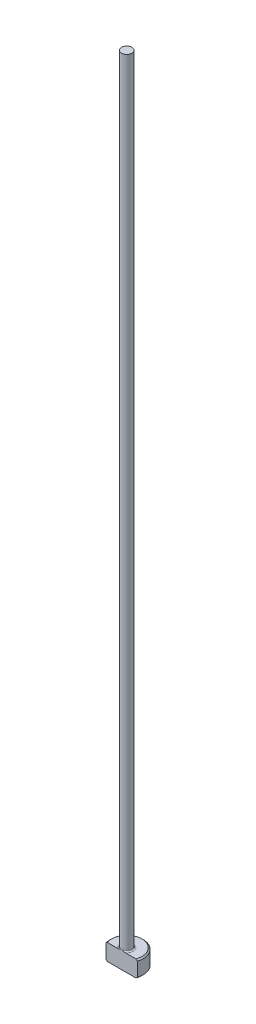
ISO-10303-21;
HEADER;
FILE_DESCRIPTION(('STEP AP214'),'2;1');
FILE_NAME('part.step','',(''),(''),'','','');
FILE_SCHEMA(('AUTOMOTIVE_DESIGN { 1 0 10303 214 1 1 1 1 }'));
ENDSEC;
DATA;
#1=APPLICATION_CONTEXT('core data for automotive mechanical design processes');
#2=APPLICATION_PROTOCOL_DEFINITION('international standard','automotive_design',2000,#1);
#3=PRODUCT_CONTEXT('',#1,'mechanical');
#4=PRODUCT('Part','Part','',(#3));
#5=PRODUCT_RELATED_PRODUCT_CATEGORY('part','',(#4));
#6=PRODUCT_DEFINITION_FORMATION('','',#4);
#7=PRODUCT_DEFINITION_CONTEXT('part definition',#1,'design');
#8=PRODUCT_DEFINITION('design','',#6,#7);
#9=PRODUCT_DEFINITION_SHAPE('','',#8);
#10=(LENGTH_UNIT() NAMED_UNIT(*) SI_UNIT(.MILLI.,.METRE.));
#11=(NAMED_UNIT(*) PLANE_ANGLE_UNIT() SI_UNIT($,.RADIAN.));
#12=(NAMED_UNIT(*) SI_UNIT($,.STERADIAN.) SOLID_ANGLE_UNIT());
#13=UNCERTAINTY_MEASURE_WITH_UNIT(LENGTH_MEASURE(1.E-05),#10,'distance_accuracy_value','');
#14=(GEOMETRIC_REPRESENTATION_CONTEXT(3) GLOBAL_UNCERTAINTY_ASSIGNED_CONTEXT((#13)) GLOBAL_UNIT_ASSIGNED_CONTEXT((#10,
#11,#12)) REPRESENTATION_CONTEXT('',''));
#15=CARTESIAN_POINT('',(0.,0.,0.));
#16=DIRECTION('',(0.,0.,1.));
#17=DIRECTION('',(1.,0.,0.));
#18=AXIS2_PLACEMENT_3D('',#15,#16,#17);
#19=CARTESIAN_POINT('',(0.,0.,0.));
#20=DIRECTION('',(0.,-1.,0.));
#21=DIRECTION('',(0.,0.,-1.));
#22=AXIS2_PLACEMENT_3D('',#19,#20,#21);
#23=PLANE('',#22);
#24=CARTESIAN_POINT('',(0.,0.,0.));
#25=DIRECTION('',(0.,-1.,0.));
#26=DIRECTION('',(0.,0.,-1.));
#27=AXIS2_PLACEMENT_3D('',#24,#25,#26);
#28=CIRCLE('',#27,2.92099999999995);
#29=CARTESIAN_POINT('',(-2.74744151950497,0.,0.991869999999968));
#30=VERTEX_POINT('',#29);
#31=CARTESIAN_POINT('',(2.74744151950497,0.,0.991869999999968));
#32=VERTEX_POINT('',#31);
#33=EDGE_CURVE('E98',#30,#32,#28,.T.);
#34=ORIENTED_EDGE('',*,*,#33,.T.);
#35=DIRECTION('',(-1.,0.,0.));
#36=VECTOR('',#35,1.);
#37=CARTESIAN_POINT('',(-3.01609331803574,0.,0.991869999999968));
#38=LINE('',#37,#36);
#39=EDGE_CURVE('E83',#32,#30,#38,.T.);
#40=ORIENTED_EDGE('',*,*,#39,.T.);
#41=EDGE_LOOP('',(#34,#40));
#42=FACE_BOUND('',#41,.T.);
#43=ADVANCED_FACE('F32',(#42),#23,.T.);
#44=CARTESIAN_POINT('',(0.,259.958771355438,0.));
#45=DIRECTION('',(0.,1.,0.));
#46=DIRECTION('',(0.,0.,1.));
#47=AXIS2_PLACEMENT_3D('',#44,#45,#46);
#48=CYLINDRICAL_SURFACE('',#47,3.17499999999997);
#49=CARTESIAN_POINT('',(0.,2.92099999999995,0.));
#50=DIRECTION('',(0.,1.,0.));
#51=DIRECTION('',(0.,0.,1.));
#52=AXIS2_PLACEMENT_3D('',#49,#50,#51);
#53=CIRCLE('',#52,3.17499999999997);
#54=CARTESIAN_POINT('',(-3.01609331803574,2.92099999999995,0.991869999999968));
#55=VERTEX_POINT('',#54);
#56=CARTESIAN_POINT('',(3.01609331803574,2.92099999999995,0.991869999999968));
#57=VERTEX_POINT('',#56);
#58=EDGE_CURVE('E104',#55,#57,#53,.F.);
#59=ORIENTED_EDGE('',*,*,#58,.T.);
#60=DIRECTION('',(0.,-1.,0.));
#61=VECTOR('',#60,1.);
#62=CARTESIAN_POINT('',(3.01609331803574,152.4,0.991869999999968));
#63=LINE('',#62,#61);
#64=CARTESIAN_POINT('',(3.01609331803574,0.254000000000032,0.991869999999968));
#65=VERTEX_POINT('',#64);
#66=EDGE_CURVE('E183',#57,#65,#63,.T.);
#67=ORIENTED_EDGE('',*,*,#66,.T.);
#68=CARTESIAN_POINT('',(0.,0.254000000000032,0.));
#69=DIRECTION('',(0.,-1.,0.));
#70=DIRECTION('',(0.,0.,-1.));
#71=AXIS2_PLACEMENT_3D('',#68,#69,#70);
#72=CIRCLE('',#71,3.17499999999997);
#73=CARTESIAN_POINT('',(-3.01609331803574,0.254000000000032,0.991869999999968));
#74=VERTEX_POINT('',#73);
#75=EDGE_CURVE('E100',#65,#74,#72,.F.);
#76=ORIENTED_EDGE('',*,*,#75,.T.);
#77=DIRECTION('',(0.,-1.,0.));
#78=VECTOR('',#77,1.);
#79=CARTESIAN_POINT('',(-3.01609331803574,152.4,0.991869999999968));
#80=LINE('',#79,#78);
#81=EDGE_CURVE('E93',#55,#74,#80,.T.);
#82=ORIENTED_EDGE('',*,*,#81,.F.);
#83=EDGE_LOOP('',(#59,#67,#76,#82));
#84=FACE_BOUND('',#83,.T.);
#85=ADVANCED_FACE('F158',(#84),#48,.T.);
#86=CARTESIAN_POINT('',(-3.17499999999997,3.175,0.));
#87=DIRECTION('',(0.,1.,0.));
#88=DIRECTION('',(0.,0.,1.));
#89=AXIS2_PLACEMENT_3D('',#86,#87,#88);
#90=PLANE('',#89);
#91=CARTESIAN_POINT('',(0.,3.175,0.));
#92=DIRECTION('',(0.,1.,0.));
#93=DIRECTION('',(0.,0.,1.));
#94=AXIS2_PLACEMENT_3D('',#91,#92,#93);
#95=CIRCLE('',#94,2.92099999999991);
#96=CARTESIAN_POINT('',(2.74744151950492,3.175,0.991869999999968));
#97=VERTEX_POINT('',#96);
#98=CARTESIAN_POINT('',(-2.74744151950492,3.175,0.991869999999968));
#99=VERTEX_POINT('',#98);
#100=EDGE_CURVE('E178',#97,#99,#95,.T.);
#101=ORIENTED_EDGE('',*,*,#100,.T.);
#102=DIRECTION('',(1.,0.,0.));
#103=VECTOR('',#102,1.);
#104=CARTESIAN_POINT('',(-3.17499999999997,3.175,0.991869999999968));
#105=LINE('',#104,#103);
#106=CARTESIAN_POINT('',(-0.753913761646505,3.17500000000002,0.991869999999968));
#107=VERTEX_POINT('',#106);
#108=EDGE_CURVE('E57',#99,#107,#105,.T.);
#109=ORIENTED_EDGE('',*,*,#108,.T.);
#110=CARTESIAN_POINT('',(0.,3.175,0.));
#111=DIRECTION('',(0.,1.,0.));
#112=DIRECTION('',(0.,0.,1.));
#113=AXIS2_PLACEMENT_3D('',#110,#111,#112);
#114=CIRCLE('',#113,1.24586999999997);
#115=CARTESIAN_POINT('',(0.753913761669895,3.17500000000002,0.991869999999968));
#116=VERTEX_POINT('',#115);
#117=EDGE_CURVE('E107',#107,#116,#114,.F.);
#118=ORIENTED_EDGE('',*,*,#117,.T.);
#119=EDGE_CURVE('E136',#116,#97,#105,.T.);
#120=ORIENTED_EDGE('',*,*,#119,.T.);
#121=EDGE_LOOP('',(#101,#109,#118,#120));
#122=FACE_BOUND('',#121,.T.);
#123=ADVANCED_FACE('F147',(#122),#90,.T.);
#124=CARTESIAN_POINT('',(0.,3.17499999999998,0.));
#125=DIRECTION('',(0.,-1.,0.));
#126=DIRECTION('',(0.,0.,-1.));
#127=AXIS2_PLACEMENT_3D('',#124,#125,#126);
#128=CONICAL_SURFACE('',#127,2.92099999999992,0.785398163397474);
#129=ORIENTED_EDGE('',*,*,#58,.F.);
#130=CARTESIAN_POINT('',(-6.63881246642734,-0.616498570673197,0.991869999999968));
#131=CARTESIAN_POINT('',(-6.44312621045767,-0.422969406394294,0.991869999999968));
#132=CARTESIAN_POINT('',(-6.2473550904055,-0.229525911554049,0.991869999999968));
#133=CARTESIAN_POINT('',(-5.85545987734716,0.157213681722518,0.991869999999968));
#134=CARTESIAN_POINT('',(-5.659335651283,0.350509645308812,0.991869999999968));
#135=CARTESIAN_POINT('',(-5.26477224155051,0.738726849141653,0.991869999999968));
#136=CARTESIAN_POINT('',(-5.06632973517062,0.933644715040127,0.991869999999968));
#137=CARTESIAN_POINT('',(-4.66907774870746,1.32289438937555,0.991869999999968));
#138=CARTESIAN_POINT('',(-4.47026851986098,1.51722645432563,0.991869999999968));
#139=CARTESIAN_POINT('',(-3.99842986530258,1.97685787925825,0.991869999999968));
#140=CARTESIAN_POINT('',(-3.725108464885,2.24185852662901,0.991869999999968));
#141=CARTESIAN_POINT('',(-3.31312452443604,2.63779317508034,0.991869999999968));
#142=CARTESIAN_POINT('',(-3.17533325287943,2.76963275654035,0.991869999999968));
#143=CARTESIAN_POINT('',(-2.89892508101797,3.03238768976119,0.991869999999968));
#144=CARTESIAN_POINT('',(-2.76030835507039,3.16330322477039,0.991869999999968));
#145=CARTESIAN_POINT('',(-2.482906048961,3.42276045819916,0.991869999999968));
#146=CARTESIAN_POINT('',(-2.34413040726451,3.5513127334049,0.991869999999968));
#147=CARTESIAN_POINT('',(-2.13441370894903,3.74255178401,0.991869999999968));
#148=CARTESIAN_POINT('',(-2.06422089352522,3.80605831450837,0.991869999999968));
#149=CARTESIAN_POINT('',(-1.9231794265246,3.93233800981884,0.991869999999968));
#150=CARTESIAN_POINT('',(-1.85233078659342,3.99511118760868,0.991869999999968));
#151=CARTESIAN_POINT('',(-1.71000639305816,4.11945450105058,0.991869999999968));
#152=CARTESIAN_POINT('',(-1.63853357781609,4.18102799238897,0.991869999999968));
#153=CARTESIAN_POINT('',(-1.49441993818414,4.30278887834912,0.991869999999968));
#154=CARTESIAN_POINT('',(-1.42177920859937,4.36297638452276,0.991869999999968));
#155=CARTESIAN_POINT('',(-1.27495157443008,4.48125102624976,0.991869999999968));
#156=CARTESIAN_POINT('',(-1.20076671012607,4.53934068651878,0.991869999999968));
#157=CARTESIAN_POINT('',(-1.05007271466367,4.65240890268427,0.991869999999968));
#158=CARTESIAN_POINT('',(-0.973564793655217,4.70738903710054,0.991869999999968));
#159=CARTESIAN_POINT('',(-0.875280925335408,4.77323526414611,0.991869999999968));
#160=CARTESIAN_POINT('',(-0.855113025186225,4.78650227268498,0.991869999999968));
#161=CARTESIAN_POINT('',(-0.814520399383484,4.81264212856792,0.991869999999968));
#162=CARTESIAN_POINT('',(-0.794095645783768,4.8255149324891,0.991869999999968));
#163=CARTESIAN_POINT('',(-0.732395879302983,4.86345987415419,0.991869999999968));
#164=CARTESIAN_POINT('',(-0.690699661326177,4.88785562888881,0.991869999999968));
#165=CARTESIAN_POINT('',(-0.606286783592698,4.93403928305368,0.991869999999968));
#166=CARTESIAN_POINT('',(-0.563580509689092,4.95584589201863,0.991869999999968));
#167=CARTESIAN_POINT('',(-0.476672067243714,4.99620995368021,0.991869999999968));
#168=CARTESIAN_POINT('',(-0.432470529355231,5.0147687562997,0.991869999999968));
#169=CARTESIAN_POINT('',(-0.329306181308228,5.05228686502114,0.991869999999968));
#170=CARTESIAN_POINT('',(-0.269781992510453,5.06979957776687,0.991869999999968));
#171=CARTESIAN_POINT('',(-0.179052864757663,5.0885330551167,0.991869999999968));
#172=CARTESIAN_POINT('',(-0.148613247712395,5.09351986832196,0.991869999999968));
#173=CARTESIAN_POINT('',(-0.0874154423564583,5.10074793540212,0.991869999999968));
#174=CARTESIAN_POINT('',(-0.0566574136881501,5.10299050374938,0.991869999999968));
#175=CARTESIAN_POINT('',(0.00511172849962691,5.10459993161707,0.991869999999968));
#176=CARTESIAN_POINT('',(0.0361232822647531,5.10395023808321,0.991869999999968));
#177=CARTESIAN_POINT('',(0.0979483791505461,5.09978428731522,0.991869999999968));
#178=CARTESIAN_POINT('',(0.128761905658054,5.09626779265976,0.991869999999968));
#179=CARTESIAN_POINT('',(0.220714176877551,5.08166838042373,0.991869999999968));
#180=CARTESIAN_POINT('',(0.281225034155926,5.06653323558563,0.991869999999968));
#181=CARTESIAN_POINT('',(0.400349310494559,5.027904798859,0.991869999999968));
#182=CARTESIAN_POINT('',(0.45892064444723,5.00428952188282,0.991869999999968));
#183=CARTESIAN_POINT('',(0.573499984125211,4.95139280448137,0.991869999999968));
#184=CARTESIAN_POINT('',(0.629503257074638,4.92210138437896,0.991869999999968));
#185=CARTESIAN_POINT('',(0.739751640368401,4.85948719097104,0.991869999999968));
#186=CARTESIAN_POINT('',(0.793979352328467,4.82613437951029,0.991869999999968));
#187=CARTESIAN_POINT('',(0.900666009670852,4.75683375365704,0.991869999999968));
#188=CARTESIAN_POINT('',(0.953126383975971,4.72088811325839,0.991869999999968));
#189=CARTESIAN_POINT('',(1.06104536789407,4.64408113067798,0.991869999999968));
#190=CARTESIAN_POINT('',(1.1163892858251,4.60305981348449,0.991869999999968));
#191=CARTESIAN_POINT('',(1.22590846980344,4.51948043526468,0.991869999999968));
#192=CARTESIAN_POINT('',(1.28008357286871,4.47692216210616,0.991869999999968));
#193=CARTESIAN_POINT('',(1.44133090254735,4.34754947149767,0.991869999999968));
#194=CARTESIAN_POINT('',(1.54706954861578,4.25907815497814,0.991869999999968));
#195=CARTESIAN_POINT('',(1.75655910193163,4.07945758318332,0.991869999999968));
#196=CARTESIAN_POINT('',(1.86030595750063,3.98830366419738,0.991869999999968));
#197=CARTESIAN_POINT('',(2.06632932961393,3.80441354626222,0.991869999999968));
#198=CARTESIAN_POINT('',(2.16860627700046,3.71167782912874,0.991869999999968));
#199=CARTESIAN_POINT('',(2.37189582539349,3.52538688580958,0.991869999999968));
#200=CARTESIAN_POINT('',(2.47291111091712,3.43183457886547,0.991869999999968));
#201=CARTESIAN_POINT('',(2.6742440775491,3.24396827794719,0.991869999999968));
#202=CARTESIAN_POINT('',(2.7745617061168,3.14965422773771,0.991869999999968));
#203=CARTESIAN_POINT('',(3.07453396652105,2.86609752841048,0.991869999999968));
#204=CARTESIAN_POINT('',(3.27342077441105,2.67604349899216,0.991869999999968));
#205=CARTESIAN_POINT('',(3.73814308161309,2.2291934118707,0.991869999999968));
#206=CARTESIAN_POINT('',(4.00350145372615,1.97190269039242,0.991869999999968));
#207=CARTESIAN_POINT('',(4.53313081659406,1.45600494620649,0.991869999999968));
#208=CARTESIAN_POINT('',(4.79740135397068,1.19739745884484,0.991869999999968));
#209=CARTESIAN_POINT('',(5.32485114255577,0.679796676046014,0.991869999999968));
#210=CARTESIAN_POINT('',(5.58803139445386,0.420804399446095,0.991869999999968));
#211=CARTESIAN_POINT('',(6.11378961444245,-0.097580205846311,0.991869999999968));
#212=CARTESIAN_POINT('',(6.37636778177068,-0.356972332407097,0.991869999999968));
#213=CARTESIAN_POINT('',(6.63881246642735,-0.616498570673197,0.991869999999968));
#214=B_SPLINE_CURVE_WITH_KNOTS('',3,(#130,#131,#132,#133,#134,#135,#136,#137,#138,#139,#140,
#141,#142,#143,#144,#145,#146,#147,#148,#149,#150,#151,#152,#153,#154,#155,#156,#157,#158,#159,
#160,#161,#162,#163,#164,#165,#166,#167,#168,#169,#170,#171,#172,#173,#174,#175,#176,#177,#178,
#179,#180,#181,#182,#183,#184,#185,#186,#187,#188,#189,#190,#191,#192,#193,#194,#195,#196,#197,
#198,#199,#200,#201,#202,#203,#204,#205,#206,#207,#208,#209,#210,#211,#212,#213),.UNSPECIFIED.,
.F.,.F.,(4,2,2,2,2,2,2,2,2,2,2,2,2,2,2,2,2,2,2,2,2,2,2,2,2,2,2,2,2,2,2,2,2,2,2,2,2,2,2,2,2,4),
(0.,0.825663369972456,1.65176992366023,2.48624600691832,3.32027837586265,4.46235847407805,
5.03446835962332,5.60646140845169,6.17394701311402,6.45791698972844,6.74188193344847,
7.02488468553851,7.30786457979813,7.59049172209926,7.87297407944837,7.94539117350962,
8.0178162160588,8.1626818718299,8.30642716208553,8.45011256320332,8.63549367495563,
8.72792412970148,8.82031029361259,8.91322588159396,9.00614916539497,9.19240828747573,
9.38146172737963,9.57085062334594,9.7617366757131,9.95246449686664,10.1590941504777,
10.3657524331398,10.7792760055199,11.193566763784,11.6077335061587,12.0207724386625,
12.4338421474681,13.2591119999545,14.3679437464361,15.477198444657,16.5849285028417,
17.6922142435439),.UNSPECIFIED.);
#215=EDGE_CURVE('E135',#55,#99,#214,.T.);
#216=ORIENTED_EDGE('',*,*,#215,.T.);
#217=ORIENTED_EDGE('',*,*,#100,.F.);
#218=EDGE_CURVE('E127',#97,#57,#214,.T.);
#219=ORIENTED_EDGE('',*,*,#218,.T.);
#220=EDGE_LOOP('',(#129,#216,#217,#219));
#221=FACE_BOUND('',#220,.T.);
#222=ADVANCED_FACE('F143',(#221),#128,.T.);
#223=CARTESIAN_POINT('',(0.,0.254000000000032,0.));
#224=DIRECTION('',(0.,1.,0.));
#225=DIRECTION('',(0.,0.,1.));
#226=AXIS2_PLACEMENT_3D('',#223,#224,#225);
#227=CONICAL_SURFACE('',#226,3.17499999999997,0.785398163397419);
#228=ORIENTED_EDGE('',*,*,#75,.F.);
#229=CARTESIAN_POINT('',(6.63881246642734,3.79149857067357,0.991869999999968));
#230=CARTESIAN_POINT('',(6.44312621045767,3.59796940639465,0.991869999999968));
#231=CARTESIAN_POINT('',(6.2473550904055,3.40452591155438,0.991869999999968));
#232=CARTESIAN_POINT('',(5.85545987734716,3.01778631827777,0.991869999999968));
#233=CARTESIAN_POINT('',(5.659335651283,2.82449035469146,0.991869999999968));
#234=CARTESIAN_POINT('',(5.26477224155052,2.43627315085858,0.991869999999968));
#235=CARTESIAN_POINT('',(5.06632973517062,2.24135528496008,0.991869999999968));
#236=CARTESIAN_POINT('',(4.66907774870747,1.85210561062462,0.991869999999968));
#237=CARTESIAN_POINT('',(4.470268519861,1.65777354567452,0.991869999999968));
#238=CARTESIAN_POINT('',(3.9984298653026,1.19814212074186,0.991869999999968));
#239=CARTESIAN_POINT('',(3.72510846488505,0.933141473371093,0.991869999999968));
#240=CARTESIAN_POINT('',(3.3131245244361,0.537206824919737,0.991869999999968));
#241=CARTESIAN_POINT('',(3.1753332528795,0.405367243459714,0.991869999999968));
#242=CARTESIAN_POINT('',(2.89892508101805,0.142612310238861,0.991869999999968));
#243=CARTESIAN_POINT('',(2.76030835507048,0.0116967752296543,0.991869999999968));
#244=CARTESIAN_POINT('',(2.48290604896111,-0.247760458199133,0.991869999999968));
#245=CARTESIAN_POINT('',(2.34413040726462,-0.376312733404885,0.991869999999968));
#246=CARTESIAN_POINT('',(2.13441370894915,-0.567551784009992,0.991869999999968));
#247=CARTESIAN_POINT('',(2.06422089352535,-0.631058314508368,0.991869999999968));
#248=CARTESIAN_POINT('',(1.92317942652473,-0.75733800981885,0.991869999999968));
#249=CARTESIAN_POINT('',(1.85233078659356,-0.820111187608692,0.991869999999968));
#250=CARTESIAN_POINT('',(1.71000639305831,-0.944454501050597,0.991869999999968));
#251=CARTESIAN_POINT('',(1.63853357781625,-1.00602799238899,0.991869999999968));
#252=CARTESIAN_POINT('',(1.4944199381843,-1.12778887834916,0.991869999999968));
#253=CARTESIAN_POINT('',(1.42177920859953,-1.18797638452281,0.991869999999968));
#254=CARTESIAN_POINT('',(1.27495157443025,-1.30625102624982,0.991869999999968));
#255=CARTESIAN_POINT('',(1.20076671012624,-1.36434068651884,0.991869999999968));
#256=CARTESIAN_POINT('',(1.05007271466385,-1.47740890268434,0.991869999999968));
#257=CARTESIAN_POINT('',(0.973564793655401,-1.53238903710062,0.991869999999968));
#258=CARTESIAN_POINT('',(0.875280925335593,-1.59823526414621,0.991869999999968));
#259=CARTESIAN_POINT('',(0.855113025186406,-1.61150227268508,0.991869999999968));
#260=CARTESIAN_POINT('',(0.814520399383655,-1.63764212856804,0.991869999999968));
#261=CARTESIAN_POINT('',(0.794095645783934,-1.65051493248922,0.991869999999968));
#262=CARTESIAN_POINT('',(0.732395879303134,-1.68845987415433,0.991869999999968));
#263=CARTESIAN_POINT('',(0.690699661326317,-1.71285562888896,0.991869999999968));
#264=CARTESIAN_POINT('',(0.606286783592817,-1.75903928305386,0.991869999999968));
#265=CARTESIAN_POINT('',(0.563580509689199,-1.78084589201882,0.991869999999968));
#266=CARTESIAN_POINT('',(0.476672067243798,-1.82120995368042,0.991869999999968));
#267=CARTESIAN_POINT('',(0.432470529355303,-1.83976875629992,0.991869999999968));
#268=CARTESIAN_POINT('',(0.329306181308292,-1.87728686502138,0.991869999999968));
#269=CARTESIAN_POINT('',(0.269781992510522,-1.89479957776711,0.991869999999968));
#270=CARTESIAN_POINT('',(0.179052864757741,-1.91353305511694,0.991869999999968));
#271=CARTESIAN_POINT('',(0.148613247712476,-1.9185198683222,0.991869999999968));
#272=CARTESIAN_POINT('',(0.0874154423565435,-1.92574793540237,0.991869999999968));
#273=CARTESIAN_POINT('',(0.0566574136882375,-1.92799050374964,0.991869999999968));
#274=CARTESIAN_POINT('',(-0.00511172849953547,-1.92959993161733,0.991869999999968));
#275=CARTESIAN_POINT('',(-0.0361232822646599,-1.92895023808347,0.991869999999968));
#276=CARTESIAN_POINT('',(-0.0979483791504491,-1.92478428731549,0.991869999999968));
#277=CARTESIAN_POINT('',(-0.128761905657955,-1.92126779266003,0.991869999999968));
#278=CARTESIAN_POINT('',(-0.220714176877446,-1.90666838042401,0.991869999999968));
#279=CARTESIAN_POINT('',(-0.281225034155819,-1.89153323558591,0.991869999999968));
#280=CARTESIAN_POINT('',(-0.400349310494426,-1.8529047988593,0.991869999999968));
#281=CARTESIAN_POINT('',(-0.458920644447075,-1.82928952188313,0.991869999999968));
#282=CARTESIAN_POINT('',(-0.573499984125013,-1.77639280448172,0.991869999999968));
#283=CARTESIAN_POINT('',(-0.629503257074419,-1.74710138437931,0.991869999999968));
#284=CARTESIAN_POINT('',(-0.73975164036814,-1.68448719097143,0.991869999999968));
#285=CARTESIAN_POINT('',(-0.793979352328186,-1.65113437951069,0.991869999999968));
#286=CARTESIAN_POINT('',(-0.90066600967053,-1.58183375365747,0.991869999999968));
#287=CARTESIAN_POINT('',(-0.953126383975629,-1.54588811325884,0.991869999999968));
#288=CARTESIAN_POINT('',(-1.06104536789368,-1.46908113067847,0.991869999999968));
#289=CARTESIAN_POINT('',(-1.11638928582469,-1.42805981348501,0.991869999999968));
#290=CARTESIAN_POINT('',(-1.22590846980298,-1.34448043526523,0.991869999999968));
#291=CARTESIAN_POINT('',(-1.28008357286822,-1.30192216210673,0.991869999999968));
#292=CARTESIAN_POINT('',(-1.44133090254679,-1.1725494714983,0.991869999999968));
#293=CARTESIAN_POINT('',(-1.54706954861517,-1.08407815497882,0.991869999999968));
#294=CARTESIAN_POINT('',(-1.75655910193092,-0.90445758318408,0.991869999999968));
#295=CARTESIAN_POINT('',(-1.86030595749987,-0.813303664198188,0.991869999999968));
#296=CARTESIAN_POINT('',(-2.06632932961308,-0.629413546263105,0.991869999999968));
#297=CARTESIAN_POINT('',(-2.16860627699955,-0.536677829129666,0.991869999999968));
#298=CARTESIAN_POINT('',(-2.37189582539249,-0.350386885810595,0.991869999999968));
#299=CARTESIAN_POINT('',(-2.47291111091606,-0.25683457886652,0.991869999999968));
#300=CARTESIAN_POINT('',(-2.67424407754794,-0.068968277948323,0.991869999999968));
#301=CARTESIAN_POINT('',(-2.7745617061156,0.0253457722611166,0.991869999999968));
#302=CARTESIAN_POINT('',(-3.0745339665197,0.30890247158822,0.991869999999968));
#303=CARTESIAN_POINT('',(-3.2734207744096,0.498956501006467,0.991869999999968));
#304=CARTESIAN_POINT('',(-3.73814308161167,0.945806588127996,0.991869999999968));
#305=CARTESIAN_POINT('',(-4.00350145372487,1.20309730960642,0.991869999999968));
#306=CARTESIAN_POINT('',(-4.53313081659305,1.71899505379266,0.991869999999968));
#307=CARTESIAN_POINT('',(-4.7974013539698,1.97760254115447,0.991869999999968));
#308=CARTESIAN_POINT('',(-5.32485114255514,2.4952033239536,0.991869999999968));
#309=CARTESIAN_POINT('',(-5.58803139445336,2.75419560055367,0.991869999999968));
#310=CARTESIAN_POINT('',(-6.11378961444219,3.27258020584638,0.991869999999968));
#311=CARTESIAN_POINT('',(-6.37636778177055,3.53197233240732,0.991869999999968));
#312=CARTESIAN_POINT('',(-6.63881246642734,3.79149857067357,0.991869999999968));
#313=B_SPLINE_CURVE_WITH_KNOTS('',3,(#229,#230,#231,#232,#233,#234,#235,#236,#237,#238,#239,
#240,#241,#242,#243,#244,#245,#246,#247,#248,#249,#250,#251,#252,#253,#254,#255,#256,#257,#258,
#259,#260,#261,#262,#263,#264,#265,#266,#267,#268,#269,#270,#271,#272,#273,#274,#275,#276,#277,
#278,#279,#280,#281,#282,#283,#284,#285,#286,#287,#288,#289,#290,#291,#292,#293,#294,#295,#296,
#297,#298,#299,#300,#301,#302,#303,#304,#305,#306,#307,#308,#309,#310,#311,#312),.UNSPECIFIED.,
.F.,.F.,(4,2,2,2,2,2,2,2,2,2,2,2,2,2,2,2,2,2,2,2,2,2,2,2,2,2,2,2,2,2,2,2,2,2,2,2,2,2,2,2,2,4),
(0.,0.825663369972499,1.65176992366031,2.48624600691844,3.32027837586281,4.46235847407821,
5.03446835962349,5.60646140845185,6.17394701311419,6.45791698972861,6.74188193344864,
7.02488468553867,7.3078645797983,7.59049172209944,7.87297407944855,7.94539117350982,
8.01781621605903,8.16268187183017,8.30642716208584,8.45011256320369,8.63549367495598,
8.72792412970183,8.82031029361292,8.91322588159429,9.0061491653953,9.19240828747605,
9.38146172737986,9.5708506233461,9.76173667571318,9.95246449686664,10.1590941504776,
10.3657524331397,10.7792760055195,11.1935667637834,11.6077335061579,12.0207724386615,
12.433842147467,13.2591119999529,14.3679437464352,15.4771984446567,16.584928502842,
17.6922142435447),.UNSPECIFIED.);
#314=EDGE_CURVE('E86',#65,#32,#313,.T.);
#315=ORIENTED_EDGE('',*,*,#314,.T.);
#316=ORIENTED_EDGE('',*,*,#33,.F.);
#317=EDGE_CURVE('E89',#30,#74,#313,.T.);
#318=ORIENTED_EDGE('',*,*,#317,.T.);
#319=EDGE_LOOP('',(#228,#315,#316,#318));
#320=FACE_BOUND('',#319,.T.);
#321=ADVANCED_FACE('F97',(#320),#227,.T.);
#322=CARTESIAN_POINT('',(0.,3.42900000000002,0.));
#323=DIRECTION('',(0.,1.,0.));
#324=DIRECTION('',(0.,0.,1.));
#325=AXIS2_PLACEMENT_3D('',#322,#323,#324);
#326=TOROIDAL_SURFACE('',#325,1.24586999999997,0.254);
#327=CARTESIAN_POINT('',(0.,3.42900000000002,0.991869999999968));
#328=CARTESIAN_POINT('',(4.02377171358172E-11,3.42900058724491,0.991869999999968));
#329=CARTESIAN_POINT('',(9.15420536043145E-08,3.42900117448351,0.991869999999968));
#330=CARTESIAN_POINT('',(3.97418528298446E-07,3.42900231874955,0.991869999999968));
#331=CARTESIAN_POINT('',(6.13387555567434E-07,3.42900287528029,0.991869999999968));
#332=CARTESIAN_POINT('',(1.13852671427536E-06,3.42900397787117,0.991869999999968));
#333=CARTESIAN_POINT('',(1.45202346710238E-06,3.42900452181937,0.991869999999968));
#334=CARTESIAN_POINT('',(2.14006828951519E-06,3.42900556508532,0.991869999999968));
#335=CARTESIAN_POINT('',(2.5143821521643E-06,3.42900606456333,0.991869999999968));
#336=CARTESIAN_POINT('',(3.81966318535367E-06,3.42900767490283,0.991869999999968));
#337=CARTESIAN_POINT('',(4.83193056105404E-06,3.42900872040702,0.991869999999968));
#338=CARTESIAN_POINT('',(6.96385528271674E-06,3.42901063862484,0.991869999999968));
#339=CARTESIAN_POINT('',(8.08086733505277E-06,3.42901151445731,0.991869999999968));
#340=CARTESIAN_POINT('',(1.22758630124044E-05,3.42901464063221,0.991869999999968));
#341=CARTESIAN_POINT('',(1.54854048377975E-05,3.4290167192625,0.991869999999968));
#342=CARTESIAN_POINT('',(2.19445387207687E-05,3.42902026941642,0.991869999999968));
#343=CARTESIAN_POINT('',(2.51780501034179E-05,3.42902177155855,0.991869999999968));
#344=CARTESIAN_POINT('',(3.84591566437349E-05,3.42902785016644,0.991869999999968));
#345=CARTESIAN_POINT('',(4.85743370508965E-05,3.42903226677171,0.991869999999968));
#346=CARTESIAN_POINT('',(6.78007718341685E-05,3.42903964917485,0.991869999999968));
#347=CARTESIAN_POINT('',(7.68665515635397E-05,3.42904272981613,0.991869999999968));
#348=CARTESIAN_POINT('',(0.000140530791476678,3.42906625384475,0.991869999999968));
#349=CARTESIAN_POINT('',(0.000191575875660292,3.42909512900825,0.991869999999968));
#350=CARTESIAN_POINT('',(0.000386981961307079,3.42920140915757,0.991869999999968));
#351=CARTESIAN_POINT('',(0.000533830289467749,3.42927255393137,0.991869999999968));
#352=CARTESIAN_POINT('',(0.00109306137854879,3.42954777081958,0.991869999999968));
#353=CARTESIAN_POINT('',(0.00150287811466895,3.42975838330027,0.991869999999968));
#354=CARTESIAN_POINT('',(0.00314666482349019,3.43059879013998,0.991869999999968));
#355=CARTESIAN_POINT('',(0.0043834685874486,3.43122127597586,0.991869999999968));
#356=CARTESIAN_POINT('',(0.0261880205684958,3.44220075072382,0.991869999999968));
#357=CARTESIAN_POINT('',(0.0467299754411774,3.45262603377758,0.991869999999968));
#358=CARTESIAN_POINT('',(0.0872024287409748,3.47296015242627,0.991869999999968));
#359=CARTESIAN_POINT('',(0.107130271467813,3.48287456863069,0.991869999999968));
#360=CARTESIAN_POINT('',(0.149227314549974,3.50352978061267,0.991869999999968));
#361=CARTESIAN_POINT('',(0.171408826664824,3.51424589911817,0.991869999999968));
#362=CARTESIAN_POINT('',(0.216186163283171,3.53533644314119,0.991869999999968));
#363=CARTESIAN_POINT('',(0.238783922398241,3.54570676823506,0.991869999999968));
#364=CARTESIAN_POINT('',(0.296177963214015,3.57111220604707,0.991869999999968));
#365=CARTESIAN_POINT('',(0.331156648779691,3.58574162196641,0.991869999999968));
#366=CARTESIAN_POINT('',(0.4012128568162,3.61261042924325,0.991869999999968));
#367=CARTESIAN_POINT('',(0.436273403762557,3.62489295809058,0.991869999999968));
#368=CARTESIAN_POINT('',(0.489086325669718,3.64107636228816,0.991869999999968));
#369=CARTESIAN_POINT('',(0.506509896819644,3.64604892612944,0.991869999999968));
#370=CARTESIAN_POINT('',(0.541631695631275,3.65523411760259,0.991869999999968));
#371=CARTESIAN_POINT('',(0.559330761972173,3.65944351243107,0.991869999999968));
#372=CARTESIAN_POINT('',(0.61440036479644,3.67107076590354,0.991869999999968));
#373=CARTESIAN_POINT('',(0.652120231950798,3.67696438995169,0.991869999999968));
#374=CARTESIAN_POINT('',(0.727960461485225,3.68344441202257,0.991869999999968));
#375=CARTESIAN_POINT('',(0.766079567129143,3.68404421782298,0.991869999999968));
#376=CARTESIAN_POINT('',(0.841341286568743,3.67821977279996,0.991869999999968));
#377=CARTESIAN_POINT('',(0.87848962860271,3.67191140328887,0.991869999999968));
#378=CARTESIAN_POINT('',(0.931416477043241,3.65597586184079,0.991869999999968));
#379=CARTESIAN_POINT('',(0.948237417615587,3.64979450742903,0.991869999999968));
#380=CARTESIAN_POINT('',(0.980892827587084,3.63511096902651,0.991869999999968));
#381=CARTESIAN_POINT('',(0.996725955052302,3.62660570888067,0.991869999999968));
#382=CARTESIAN_POINT('',(1.02446353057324,3.60857790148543,0.991869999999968));
#383=CARTESIAN_POINT('',(1.03659795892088,3.59941194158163,0.991869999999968));
#384=CARTESIAN_POINT('',(1.0592113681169,3.57922507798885,0.991869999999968));
#385=CARTESIAN_POINT('',(1.0696931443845,3.56820737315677,0.991869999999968));
#386=CARTESIAN_POINT('',(1.08653087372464,3.54680612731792,0.991869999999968));
#387=CARTESIAN_POINT('',(1.0932925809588,3.53674273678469,0.991869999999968));
#388=CARTESIAN_POINT('',(1.10506683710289,3.51563263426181,0.991869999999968));
#389=CARTESIAN_POINT('',(1.11008014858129,3.50458635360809,0.991869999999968));
#390=CARTESIAN_POINT('',(1.11808161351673,3.48170016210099,0.991869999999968));
#391=CARTESIAN_POINT('',(1.12105743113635,3.46985588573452,0.991869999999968));
#392=CARTESIAN_POINT('',(1.12472108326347,3.44581795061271,0.991869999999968));
#393=CARTESIAN_POINT('',(1.12540996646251,3.43362445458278,0.991869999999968));
#394=CARTESIAN_POINT('',(1.12450084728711,3.4105695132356,0.991869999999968));
#395=CARTESIAN_POINT('',(1.12312785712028,3.39969848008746,0.991869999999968));
#396=CARTESIAN_POINT('',(1.11858267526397,3.37834291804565,0.991869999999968));
#397=CARTESIAN_POINT('',(1.11541057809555,3.36785836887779,0.991869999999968));
#398=CARTESIAN_POINT('',(1.10742005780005,3.34747473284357,0.991869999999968));
#399=CARTESIAN_POINT('',(1.10259246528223,3.33757927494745,0.991869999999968));
#400=CARTESIAN_POINT('',(1.09152760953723,3.31861639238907,0.991869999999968));
#401=CARTESIAN_POINT('',(1.08528979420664,3.30954929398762,0.991869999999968));
#402=CARTESIAN_POINT('',(1.06900221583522,3.28901469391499,0.991869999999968));
#403=CARTESIAN_POINT('',(1.05841129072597,3.27797543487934,0.991869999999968));
#404=CARTESIAN_POINT('',(1.0355701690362,3.25776339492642,0.991869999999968));
#405=CARTESIAN_POINT('',(1.02331619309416,3.24859498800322,0.991869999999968));
#406=CARTESIAN_POINT('',(0.992881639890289,3.22901730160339,0.991869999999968));
#407=CARTESIAN_POINT('',(0.974188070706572,3.21940807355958,0.991869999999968));
#408=CARTESIAN_POINT('',(0.935577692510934,3.20329634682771,0.991869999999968));
#409=CARTESIAN_POINT('',(0.915661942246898,3.19679120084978,0.991869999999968));
#410=CARTESIAN_POINT('',(0.865000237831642,3.18386499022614,0.991869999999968));
#411=CARTESIAN_POINT('',(0.833830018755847,3.17912086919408,0.991869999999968));
#412=CARTESIAN_POINT('',(0.770778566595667,3.17440261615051,0.991869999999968));
#413=CARTESIAN_POINT('',(0.73889351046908,3.17449683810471,0.991869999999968));
#414=CARTESIAN_POINT('',(0.650464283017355,3.18012763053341,0.991869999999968));
#415=CARTESIAN_POINT('',(0.594197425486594,3.18987553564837,0.991869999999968));
#416=CARTESIAN_POINT('',(0.512937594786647,3.21001582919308,0.991869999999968));
#417=CARTESIAN_POINT('',(0.487059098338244,3.21737343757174,0.991869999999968));
#418=CARTESIAN_POINT('',(0.435897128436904,3.23347998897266,0.991869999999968));
#419=CARTESIAN_POINT('',(0.410611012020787,3.24222029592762,0.991869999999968));
#420=CARTESIAN_POINT('',(0.357071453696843,3.2620790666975,0.991869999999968));
#421=CARTESIAN_POINT('',(0.328879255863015,3.27335929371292,0.991869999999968));
#422=CARTESIAN_POINT('',(0.272339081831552,3.29725367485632,0.991869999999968));
#423=CARTESIAN_POINT('',(0.24400126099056,3.30989166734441,0.991869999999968));
#424=CARTESIAN_POINT('',(0.197260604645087,3.33151323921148,0.991869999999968));
#425=CARTESIAN_POINT('',(0.178755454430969,3.34027851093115,0.991869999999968));
#426=CARTESIAN_POINT('',(0.142033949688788,3.3579773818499,0.991869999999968));
#427=CARTESIAN_POINT('',(0.123816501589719,3.36690870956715,0.991869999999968));
#428=CARTESIAN_POINT('',(0.0892046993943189,3.38405351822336,0.991869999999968));
#429=CARTESIAN_POINT('',(0.0728034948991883,3.3922534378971,0.991869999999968));
#430=CARTESIAN_POINT('',(0.0394809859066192,3.40903742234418,0.991869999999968));
#431=CARTESIAN_POINT('',(0.0225613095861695,3.41762496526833,0.991869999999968));
#432=CARTESIAN_POINT('',(0.00438391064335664,3.42677853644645,0.991869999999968));
#433=CARTESIAN_POINT('',(0.00314752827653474,3.42740078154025,0.991869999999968));
#434=CARTESIAN_POINT('',(0.00150385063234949,3.42824112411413,0.991869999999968));
#435=CARTESIAN_POINT('',(0.00109371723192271,3.42845190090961,0.991869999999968));
#436=CARTESIAN_POINT('',(0.00053407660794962,3.42872731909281,0.991869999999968));
#437=CARTESIAN_POINT('',(0.000387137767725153,3.42879850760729,0.991869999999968));
#438=CARTESIAN_POINT('',(0.000191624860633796,3.42890484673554,0.991869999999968));
#439=CARTESIAN_POINT('',(0.000140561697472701,3.42893373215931,0.991869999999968));
#440=CARTESIAN_POINT('',(7.68760226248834E-05,3.42895726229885,0.991869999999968));
#441=CARTESIAN_POINT('',(6.78086317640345E-05,3.42896034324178,0.991869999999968));
#442=CARTESIAN_POINT('',(4.8578771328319E-05,3.42896772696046,0.991869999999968));
#443=CARTESIAN_POINT('',(3.84618178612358E-05,3.42897214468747,0.991869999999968));
#444=CARTESIAN_POINT('',(2.517871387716E-05,3.42897822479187,0.991869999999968));
#445=CARTESIAN_POINT('',(2.19449234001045E-05,3.4289797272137,0.991869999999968));
#446=CARTESIAN_POINT('',(1.54852829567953E-05,3.42898327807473,0.991869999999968));
#447=CARTESIAN_POINT('',(1.22755212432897E-05,3.42898535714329,0.991869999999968));
#448=CARTESIAN_POINT('',(8.08032848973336E-06,3.42898848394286,0.991869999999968));
#449=CARTESIAN_POINT('',(6.96329312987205E-06,3.42898935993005,0.991869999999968));
#450=CARTESIAN_POINT('',(4.83135367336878E-06,3.42899127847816,0.991869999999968));
#451=CARTESIAN_POINT('',(3.81909578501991E-06,3.42899232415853,0.991869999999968));
#452=CARTESIAN_POINT('',(2.51386598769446E-06,3.42899393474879,0.991869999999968));
#453=CARTESIAN_POINT('',(2.13957445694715E-06,3.42899443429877,0.991869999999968));
#454=CARTESIAN_POINT('',(1.4515869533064E-06,3.42899547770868,0.991869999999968));
#455=CARTESIAN_POINT('',(1.13812525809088E-06,3.42899602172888,0.991869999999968));
#456=CARTESIAN_POINT('',(6.13071424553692E-07,3.42899712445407,0.991869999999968));
#457=CARTESIAN_POINT('',(3.97151551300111E-07,3.42899768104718,0.991869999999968));
#458=CARTESIAN_POINT('',(9.13931195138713E-08,3.42899882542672,0.991869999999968));
#459=CARTESIAN_POINT('',(-4.02403615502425E-11,3.42899941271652,0.991869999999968));
#460=CARTESIAN_POINT('',(0.,3.42900000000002,0.991869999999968));
#461=B_SPLINE_CURVE_WITH_KNOTS('',3,(#327,#328,#329,#330,#331,#332,#333,#334,#335,#336,#337,
#338,#339,#340,#341,#342,#343,#344,#345,#346,#347,#348,#349,#350,#351,#352,#353,#354,#355,#356,
#357,#358,#359,#360,#361,#362,#363,#364,#365,#366,#367,#368,#369,#370,#371,#372,#373,#374,#375,
#376,#377,#378,#379,#380,#381,#382,#383,#384,#385,#386,#387,#388,#389,#390,#391,#392,#393,#394,
#395,#396,#397,#398,#399,#400,#401,#402,#403,#404,#405,#406,#407,#408,#409,#410,#411,#412,#413,
#414,#415,#416,#417,#418,#419,#420,#421,#422,#423,#424,#425,#426,#427,#428,#429,#430,#431,#432,
#433,#434,#435,#436,#437,#438,#439,#440,#441,#442,#443,#444,#445,#446,#447,#448,#449,#450,#451,
#452,#453,#454,#455,#456,#457,#458,#459,#460),.UNSPECIFIED.,.T.,.F.,(4,2,2,2,2,2,2,2,2,2,2,2,2,
2,2,2,2,2,2,2,2,2,2,2,2,2,2,2,2,2,2,2,2,2,2,2,2,2,2,2,2,2,2,2,2,2,2,2,2,2,2,2,2,2,2,2,2,2,2,2,2,
2,2,2,2,2,4),(0.,1.75981782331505E-06,3.5426956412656E-06,5.41990424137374E-06,
7.29004796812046E-06,1.16343043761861E-05,1.58889672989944E-05,2.73156387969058E-05,
3.80016508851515E-05,7.11001515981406E-05,9.97951905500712E-05,0.000274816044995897,
0.00076505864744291,0.00214648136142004,0.00630122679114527,0.0753991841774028,
0.142174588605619,0.216073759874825,0.290659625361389,0.404359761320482,0.515710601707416,
0.570051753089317,0.624617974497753,0.738846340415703,0.852785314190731,0.964841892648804,
1.01846748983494,1.07216441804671,1.11761841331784,1.16299467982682,1.19922058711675,
1.2354306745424,1.27185809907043,1.30826881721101,1.34098401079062,1.37369748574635,
1.40659516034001,1.4395057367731,1.4851472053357,1.53089418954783,1.59360068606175,
1.65625360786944,1.75031481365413,1.84570523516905,2.01592584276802,2.09662961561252,
2.17684790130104,2.26791626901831,2.36098288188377,2.42240955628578,2.48327465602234,
2.53828674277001,2.59520124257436,2.59935454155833,2.60073703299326,2.60122757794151,
2.60140266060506,2.60143136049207,2.60146446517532,2.601475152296,2.6014865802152,
2.60149083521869,2.60149517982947,2.60149705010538,2.60149892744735,2.60150071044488,
2.60150247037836),.UNSPECIFIED.);
#462=CARTESIAN_POINT('',(0.,3.42900000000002,0.991869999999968));
#463=VERTEX_POINT('',#462);
#464=EDGE_CURVE('E11',#116,#463,#461,.T.);
#465=ORIENTED_EDGE('',*,*,#464,.F.);
#466=ORIENTED_EDGE('',*,*,#117,.F.);
#467=CARTESIAN_POINT('',(0.,3.42900000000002,0.991869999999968));
#468=CARTESIAN_POINT('',(-4.02377563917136E-11,3.42899941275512,0.991869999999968));
#469=CARTESIAN_POINT('',(-9.15420536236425E-08,3.42899882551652,0.991869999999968));
#470=CARTESIAN_POINT('',(-3.97418528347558E-07,3.42899768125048,0.991869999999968));
#471=CARTESIAN_POINT('',(-6.13387555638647E-07,3.42899712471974,0.991869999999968));
#472=CARTESIAN_POINT('',(-1.13852671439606E-06,3.42899602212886,0.991869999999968));
#473=CARTESIAN_POINT('',(-1.45202346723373E-06,3.42899547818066,0.991869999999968));
#474=CARTESIAN_POINT('',(-2.14006828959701E-06,3.42899443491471,0.991869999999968));
#475=CARTESIAN_POINT('',(-2.5143821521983E-06,3.4289939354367,0.991869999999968));
#476=CARTESIAN_POINT('',(-3.81966318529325E-06,3.42899232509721,0.991869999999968));
#477=CARTESIAN_POINT('',(-4.83193056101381E-06,3.42899127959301,0.991869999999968));
#478=CARTESIAN_POINT('',(-6.96385528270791E-06,3.42898936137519,0.991869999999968));
#479=CARTESIAN_POINT('',(-8.08086733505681E-06,3.42898848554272,0.991869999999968));
#480=CARTESIAN_POINT('',(-1.22758630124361E-05,3.42898535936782,0.991869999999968));
#481=CARTESIAN_POINT('',(-1.54854048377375E-05,3.42898328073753,0.991869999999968));
#482=CARTESIAN_POINT('',(-2.19445387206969E-05,3.42897973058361,0.991869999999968));
#483=CARTESIAN_POINT('',(-2.51780501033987E-05,3.42897822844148,0.991869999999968));
#484=CARTESIAN_POINT('',(-3.84591566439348E-05,3.42897214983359,0.991869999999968));
#485=CARTESIAN_POINT('',(-4.85743370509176E-05,3.42896773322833,0.991869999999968));
#486=CARTESIAN_POINT('',(-6.78007718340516E-05,3.42896035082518,0.991869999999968));
#487=CARTESIAN_POINT('',(-7.68665515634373E-05,3.4289572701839,0.991869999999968));
#488=CARTESIAN_POINT('',(-0.000140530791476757,3.42893374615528,0.991869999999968));
#489=CARTESIAN_POINT('',(-0.000191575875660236,3.42890487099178,0.991869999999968));
#490=CARTESIAN_POINT('',(-0.000386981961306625,3.42879859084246,0.991869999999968));
#491=CARTESIAN_POINT('',(-0.000533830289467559,3.42872744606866,0.991869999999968));
#492=CARTESIAN_POINT('',(-0.00109306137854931,3.42845222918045,0.991869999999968));
#493=CARTESIAN_POINT('',(-0.00150287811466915,3.42824161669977,0.991869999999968));
#494=CARTESIAN_POINT('',(-0.00314666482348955,3.42740120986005,0.991869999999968));
#495=CARTESIAN_POINT('',(-0.00438346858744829,3.42677872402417,0.991869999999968));
#496=CARTESIAN_POINT('',(-0.0261880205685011,3.41579924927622,0.991869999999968));
#497=CARTESIAN_POINT('',(-0.0467299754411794,3.40537396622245,0.991869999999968));
#498=CARTESIAN_POINT('',(-0.087202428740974,3.38503984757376,0.991869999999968));
#499=CARTESIAN_POINT('',(-0.107130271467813,3.37512543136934,0.991869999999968));
#500=CARTESIAN_POINT('',(-0.149227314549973,3.35447021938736,0.991869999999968));
#501=CARTESIAN_POINT('',(-0.171408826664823,3.34375410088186,0.991869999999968));
#502=CARTESIAN_POINT('',(-0.21618616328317,3.32266355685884,0.991869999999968));
#503=CARTESIAN_POINT('',(-0.238783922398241,3.31229323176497,0.991869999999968));
#504=CARTESIAN_POINT('',(-0.296177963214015,3.28688779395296,0.991869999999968));
#505=CARTESIAN_POINT('',(-0.331156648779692,3.27225837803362,0.991869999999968));
#506=CARTESIAN_POINT('',(-0.4012128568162,3.24538957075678,0.991869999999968));
#507=CARTESIAN_POINT('',(-0.436273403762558,3.23310704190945,0.991869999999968));
#508=CARTESIAN_POINT('',(-0.489086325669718,3.21692363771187,0.991869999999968));
#509=CARTESIAN_POINT('',(-0.506509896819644,3.21195107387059,0.991869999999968));
#510=CARTESIAN_POINT('',(-0.541631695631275,3.20276588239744,0.991869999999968));
#511=CARTESIAN_POINT('',(-0.559330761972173,3.19855648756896,0.991869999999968));
#512=CARTESIAN_POINT('',(-0.61440036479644,3.18692923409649,0.991869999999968));
#513=CARTESIAN_POINT('',(-0.652120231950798,3.18103561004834,0.991869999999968));
#514=CARTESIAN_POINT('',(-0.727960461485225,3.17455558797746,0.991869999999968));
#515=CARTESIAN_POINT('',(-0.766079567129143,3.17395578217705,0.991869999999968));
#516=CARTESIAN_POINT('',(-0.841341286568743,3.17978022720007,0.991869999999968));
#517=CARTESIAN_POINT('',(-0.87848962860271,3.18608859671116,0.991869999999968));
#518=CARTESIAN_POINT('',(-0.931416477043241,3.20202413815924,0.991869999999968));
#519=CARTESIAN_POINT('',(-0.948237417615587,3.208205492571,0.991869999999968));
#520=CARTESIAN_POINT('',(-0.980892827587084,3.22288903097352,0.991869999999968));
#521=CARTESIAN_POINT('',(-0.996725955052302,3.23139429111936,0.991869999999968));
#522=CARTESIAN_POINT('',(-1.02446353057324,3.24942209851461,0.991869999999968));
#523=CARTESIAN_POINT('',(-1.03659795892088,3.2585880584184,0.991869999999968));
#524=CARTESIAN_POINT('',(-1.0592113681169,3.27877492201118,0.991869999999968));
#525=CARTESIAN_POINT('',(-1.0696931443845,3.28979262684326,0.991869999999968));
#526=CARTESIAN_POINT('',(-1.08653087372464,3.31119387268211,0.991869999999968));
#527=CARTESIAN_POINT('',(-1.0932925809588,3.32125726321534,0.991869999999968));
#528=CARTESIAN_POINT('',(-1.10506683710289,3.34236736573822,0.991869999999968));
#529=CARTESIAN_POINT('',(-1.11008014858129,3.35341364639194,0.991869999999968));
#530=CARTESIAN_POINT('',(-1.11808161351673,3.37629983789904,0.991869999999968));
#531=CARTESIAN_POINT('',(-1.12105743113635,3.38814411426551,0.991869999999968));
#532=CARTESIAN_POINT('',(-1.12472108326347,3.41218204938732,0.991869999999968));
#533=CARTESIAN_POINT('',(-1.12540996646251,3.42437554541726,0.991869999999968));
#534=CARTESIAN_POINT('',(-1.12450084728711,3.44743048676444,0.991869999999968));
#535=CARTESIAN_POINT('',(-1.12312785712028,3.45830151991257,0.991869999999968));
#536=CARTESIAN_POINT('',(-1.11858267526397,3.47965708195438,0.991869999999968));
#537=CARTESIAN_POINT('',(-1.11541057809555,3.49014163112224,0.991869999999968));
#538=CARTESIAN_POINT('',(-1.10742005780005,3.51052526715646,0.991869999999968));
#539=CARTESIAN_POINT('',(-1.10259246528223,3.52042072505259,0.991869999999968));
#540=CARTESIAN_POINT('',(-1.09152760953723,3.53938360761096,0.991869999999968));
#541=CARTESIAN_POINT('',(-1.08528979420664,3.54845070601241,0.991869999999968));
#542=CARTESIAN_POINT('',(-1.06900221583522,3.56898530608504,0.991869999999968));
#543=CARTESIAN_POINT('',(-1.05841129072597,3.58002456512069,0.991869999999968));
#544=CARTESIAN_POINT('',(-1.0355701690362,3.60023660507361,0.991869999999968));
#545=CARTESIAN_POINT('',(-1.02331619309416,3.60940501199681,0.991869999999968));
#546=CARTESIAN_POINT('',(-0.992881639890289,3.62898269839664,0.991869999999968));
#547=CARTESIAN_POINT('',(-0.974188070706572,3.63859192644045,0.991869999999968));
#548=CARTESIAN_POINT('',(-0.935577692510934,3.65470365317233,0.991869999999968));
#549=CARTESIAN_POINT('',(-0.915661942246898,3.66120879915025,0.991869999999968));
#550=CARTESIAN_POINT('',(-0.865000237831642,3.67413500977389,0.991869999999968));
#551=CARTESIAN_POINT('',(-0.833830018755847,3.67887913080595,0.991869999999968));
#552=CARTESIAN_POINT('',(-0.770778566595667,3.68359738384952,0.991869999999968));
#553=CARTESIAN_POINT('',(-0.73889351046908,3.68350316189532,0.991869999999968));
#554=CARTESIAN_POINT('',(-0.650464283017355,3.67787236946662,0.991869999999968));
#555=CARTESIAN_POINT('',(-0.594197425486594,3.66812446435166,0.991869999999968));
#556=CARTESIAN_POINT('',(-0.512937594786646,3.64798417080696,0.991869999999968));
#557=CARTESIAN_POINT('',(-0.487059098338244,3.64062656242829,0.991869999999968));
#558=CARTESIAN_POINT('',(-0.435897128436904,3.62452001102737,0.991869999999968));
#559=CARTESIAN_POINT('',(-0.410611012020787,3.61577970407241,0.991869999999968));
#560=CARTESIAN_POINT('',(-0.357071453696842,3.59592093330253,0.991869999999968));
#561=CARTESIAN_POINT('',(-0.328879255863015,3.58464070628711,0.991869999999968));
#562=CARTESIAN_POINT('',(-0.272339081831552,3.56074632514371,0.991869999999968));
#563=CARTESIAN_POINT('',(-0.24400126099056,3.54810833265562,0.991869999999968));
#564=CARTESIAN_POINT('',(-0.197260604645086,3.52648676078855,0.991869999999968));
#565=CARTESIAN_POINT('',(-0.178755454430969,3.51772148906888,0.991869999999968));
#566=CARTESIAN_POINT('',(-0.142033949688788,3.50002261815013,0.991869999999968));
#567=CARTESIAN_POINT('',(-0.123816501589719,3.49109129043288,0.991869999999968));
#568=CARTESIAN_POINT('',(-0.0892046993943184,3.47394648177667,0.991869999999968));
#569=CARTESIAN_POINT('',(-0.0728034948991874,3.46574656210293,0.991869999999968));
#570=CARTESIAN_POINT('',(-0.0394809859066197,3.44896257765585,0.991869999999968));
#571=CARTESIAN_POINT('',(-0.0225613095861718,3.44037503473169,0.991869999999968));
#572=CARTESIAN_POINT('',(-0.00438391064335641,3.43122146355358,0.991869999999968));
#573=CARTESIAN_POINT('',(-0.00314752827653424,3.43059921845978,0.991869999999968));
#574=CARTESIAN_POINT('',(-0.00150385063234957,3.4297588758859,0.991869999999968));
#575=CARTESIAN_POINT('',(-0.00109371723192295,3.42954809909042,0.991869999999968));
#576=CARTESIAN_POINT('',(-0.000534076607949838,3.42927268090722,0.991869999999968));
#577=CARTESIAN_POINT('',(-0.0003871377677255,3.42920149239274,0.991869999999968));
#578=CARTESIAN_POINT('',(-0.00019162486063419,3.42909515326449,0.991869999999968));
#579=CARTESIAN_POINT('',(-0.000140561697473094,3.42906626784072,0.991869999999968));
#580=CARTESIAN_POINT('',(-7.68760226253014E-05,3.42904273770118,0.991869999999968));
#581=CARTESIAN_POINT('',(-6.78086317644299E-05,3.42903965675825,0.991869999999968));
#582=CARTESIAN_POINT('',(-4.85787713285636E-05,3.42903227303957,0.991869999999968));
#583=CARTESIAN_POINT('',(-3.84618178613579E-05,3.42902785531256,0.991869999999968));
#584=CARTESIAN_POINT('',(-2.51787138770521E-05,3.42902177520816,0.991869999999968));
#585=CARTESIAN_POINT('',(-2.19449233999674E-05,3.42902027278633,0.991869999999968));
#586=CARTESIAN_POINT('',(-1.54852829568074E-05,3.4290167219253,0.991869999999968));
#587=CARTESIAN_POINT('',(-1.22755212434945E-05,3.42901464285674,0.991869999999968));
#588=CARTESIAN_POINT('',(-8.08032848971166E-06,3.42901151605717,0.991869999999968));
#589=CARTESIAN_POINT('',(-6.96329312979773E-06,3.42901064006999,0.991869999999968));
#590=CARTESIAN_POINT('',(-4.83135367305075E-06,3.42900872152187,0.991869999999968));
#591=CARTESIAN_POINT('',(-3.81909578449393E-06,3.42900767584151,0.991869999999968));
#592=CARTESIAN_POINT('',(-2.51386598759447E-06,3.42900606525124,0.991869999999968));
#593=CARTESIAN_POINT('',(-2.13957445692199E-06,3.42900556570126,0.991869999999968));
#594=CARTESIAN_POINT('',(-1.45158695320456E-06,3.42900452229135,0.991869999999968));
#595=CARTESIAN_POINT('',(-1.13812525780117E-06,3.42900397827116,0.991869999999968));
#596=CARTESIAN_POINT('',(-6.13071424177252E-07,3.42900287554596,0.991869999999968));
#597=CARTESIAN_POINT('',(-3.97151551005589E-07,3.42900231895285,0.991869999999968));
#598=CARTESIAN_POINT('',(-9.13931193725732E-08,3.42900117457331,0.991869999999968));
#599=CARTESIAN_POINT('',(4.02404008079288E-11,3.42900058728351,0.991869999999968));
#600=CARTESIAN_POINT('',(0.,3.42900000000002,0.991869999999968));
#601=B_SPLINE_CURVE_WITH_KNOTS('',3,(#467,#468,#469,#470,#471,#472,#473,#474,#475,#476,#477,
#478,#479,#480,#481,#482,#483,#484,#485,#486,#487,#488,#489,#490,#491,#492,#493,#494,#495,#496,
#497,#498,#499,#500,#501,#502,#503,#504,#505,#506,#507,#508,#509,#510,#511,#512,#513,#514,#515,
#516,#517,#518,#519,#520,#521,#522,#523,#524,#525,#526,#527,#528,#529,#530,#531,#532,#533,#534,
#535,#536,#537,#538,#539,#540,#541,#542,#543,#544,#545,#546,#547,#548,#549,#550,#551,#552,#553,
#554,#555,#556,#557,#558,#559,#560,#561,#562,#563,#564,#565,#566,#567,#568,#569,#570,#571,#572,
#573,#574,#575,#576,#577,#578,#579,#580,#581,#582,#583,#584,#585,#586,#587,#588,#589,#590,#591,
#592,#593,#594,#595,#596,#597,#598,#599,#600),.UNSPECIFIED.,.T.,.F.,(4,2,2,2,2,2,2,2,2,2,2,2,2,
2,2,2,2,2,2,2,2,2,2,2,2,2,2,2,2,2,2,2,2,2,2,2,2,2,2,2,2,2,2,2,2,2,2,2,2,2,2,2,2,2,2,2,2,2,2,2,2,
2,2,2,2,2,4),(0.,1.75981782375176E-06,3.54269564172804E-06,5.41990424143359E-06,
7.2900479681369E-06,1.16343043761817E-05,1.58889672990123E-05,2.7315638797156E-05,
3.80016508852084E-05,7.11001515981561E-05,9.97951905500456E-05,0.000274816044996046,
0.000765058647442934,0.00214648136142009,0.00630122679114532,0.0753991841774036,
0.142174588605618,0.216073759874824,0.290659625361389,0.404359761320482,0.515710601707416,
0.570051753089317,0.624617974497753,0.738846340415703,0.852785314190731,0.964841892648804,
1.01846748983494,1.07216441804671,1.11761841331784,1.16299467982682,1.19922058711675,
1.2354306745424,1.27185809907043,1.30826881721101,1.34098401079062,1.37369748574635,
1.40659516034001,1.4395057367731,1.4851472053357,1.53089418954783,1.59360068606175,
1.65625360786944,1.75031481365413,1.84570523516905,2.01592584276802,2.09662961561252,
2.17684790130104,2.26791626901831,2.36098288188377,2.42240955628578,2.48327465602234,
2.53828674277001,2.59520124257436,2.59935454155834,2.60073703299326,2.60122757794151,
2.60140266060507,2.60143136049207,2.60146446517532,2.601475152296,2.60148658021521,
2.60149083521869,2.60149517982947,2.60149705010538,2.60149892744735,2.60150071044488,
2.60150247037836),.UNSPECIFIED.);
#602=EDGE_CURVE('E46',#463,#107,#601,.T.);
#603=ORIENTED_EDGE('',*,*,#602,.F.);
#604=CARTESIAN_POINT('',(0.,3.42900000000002,0.));
#605=DIRECTION('',(0.,1.,0.));
#606=DIRECTION('',(0.,0.,1.));
#607=AXIS2_PLACEMENT_3D('',#604,#605,#606);
#608=CIRCLE('',#607,0.991869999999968);
#609=EDGE_CURVE('E103',#463,#463,#608,.T.);
#610=ORIENTED_EDGE('',*,*,#609,.F.);
#611=EDGE_LOOP('',(#465,#466,#603,#610));
#612=FACE_BOUND('',#611,.T.);
#613=ADVANCED_FACE('F34',(#612),#326,.F.);
#614=CARTESIAN_POINT('',(0.,259.958771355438,0.));
#615=DIRECTION('',(0.,1.,0.));
#616=DIRECTION('',(0.,0.,1.));
#617=AXIS2_PLACEMENT_3D('',#614,#615,#616);
#618=CYLINDRICAL_SURFACE('',#617,0.991869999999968);
#619=ORIENTED_EDGE('',*,*,#609,.T.);
#620=EDGE_LOOP('',(#619));
#621=FACE_BOUND('',#620,.T.);
#622=CARTESIAN_POINT('',(0.,152.4,0.));
#623=DIRECTION('',(0.,1.,0.));
#624=DIRECTION('',(0.,0.,1.));
#625=AXIS2_PLACEMENT_3D('',#622,#623,#624);
#626=CIRCLE('',#625,0.991869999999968);
#627=CARTESIAN_POINT('',(0.,152.4,0.991869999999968));
#628=VERTEX_POINT('',#627);
#629=EDGE_CURVE('E101',#628,#628,#626,.T.);
#630=ORIENTED_EDGE('',*,*,#629,.F.);
#631=EDGE_LOOP('',(#630));
#632=FACE_BOUND('',#631,.T.);
#633=ADVANCED_FACE('F155',(#621,#632),#618,.T.);
#634=CARTESIAN_POINT('',(-0.991869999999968,152.4,0.));
#635=DIRECTION('',(0.,1.,0.));
#636=DIRECTION('',(0.,0.,1.));
#637=AXIS2_PLACEMENT_3D('',#634,#635,#636);
#638=PLANE('',#637);
#639=ORIENTED_EDGE('',*,*,#629,.T.);
#640=EDGE_LOOP('',(#639));
#641=FACE_BOUND('',#640,.T.);
#642=ADVANCED_FACE('F121',(#641),#638,.T.);
#643=CARTESIAN_POINT('',(-3.01609331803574,152.4,0.991869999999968));
#644=DIRECTION('',(0.,0.,1.));
#645=DIRECTION('',(1.,0.,0.));
#646=AXIS2_PLACEMENT_3D('',#643,#644,#645);
#647=PLANE('',#646);
#648=ORIENTED_EDGE('',*,*,#66,.F.);
#649=ORIENTED_EDGE('',*,*,#218,.F.);
#650=ORIENTED_EDGE('',*,*,#119,.F.);
#651=ORIENTED_EDGE('',*,*,#464,.T.);
#652=ORIENTED_EDGE('',*,*,#602,.T.);
#653=ORIENTED_EDGE('',*,*,#108,.F.);
#654=ORIENTED_EDGE('',*,*,#215,.F.);
#655=ORIENTED_EDGE('',*,*,#81,.T.);
#656=ORIENTED_EDGE('',*,*,#317,.F.);
#657=ORIENTED_EDGE('',*,*,#39,.F.);
#658=ORIENTED_EDGE('',*,*,#314,.F.);
#659=EDGE_LOOP('',(#648,#649,#650,#651,#652,#653,#654,#655,#656,#657,#658));
#660=FACE_BOUND('',#659,.T.);
#661=ADVANCED_FACE('F85',(#660),#647,.T.);
#662=CLOSED_SHELL('',(#43,#85,#123,#222,#321,#613,#633,#642,#661));
#663=MANIFOLD_SOLID_BREP('B2',#662);
#664=ADVANCED_BREP_SHAPE_REPRESENTATION('',(#18,#663),#14);
#665=SHAPE_DEFINITION_REPRESENTATION(#9,#664);
ENDSEC;
END-ISO-10303-21;
